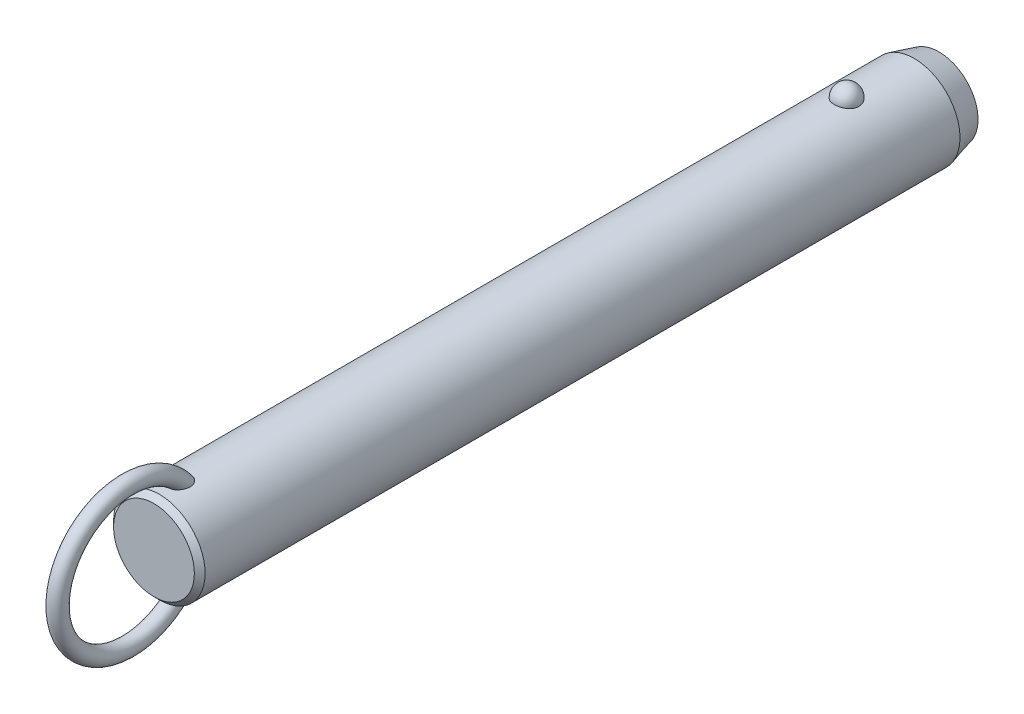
ISO-10303-21;
HEADER;
FILE_DESCRIPTION(('STEP AP214'),'2;1');
FILE_NAME('part.step','',(''),(''),'','','');
FILE_SCHEMA(('AUTOMOTIVE_DESIGN { 1 0 10303 214 1 1 1 1 }'));
ENDSEC;
DATA;
#1=APPLICATION_CONTEXT('core data for automotive mechanical design processes');
#2=APPLICATION_PROTOCOL_DEFINITION('international standard','automotive_design',2000,#1);
#3=PRODUCT_CONTEXT('',#1,'mechanical');
#4=PRODUCT('Part','Part','',(#3));
#5=PRODUCT_RELATED_PRODUCT_CATEGORY('part','',(#4));
#6=PRODUCT_DEFINITION_FORMATION('','',#4);
#7=PRODUCT_DEFINITION_CONTEXT('part definition',#1,'design');
#8=PRODUCT_DEFINITION('design','',#6,#7);
#9=PRODUCT_DEFINITION_SHAPE('','',#8);
#10=(LENGTH_UNIT() NAMED_UNIT(*) SI_UNIT(.MILLI.,.METRE.));
#11=(NAMED_UNIT(*) PLANE_ANGLE_UNIT() SI_UNIT($,.RADIAN.));
#12=(NAMED_UNIT(*) SI_UNIT($,.STERADIAN.) SOLID_ANGLE_UNIT());
#13=UNCERTAINTY_MEASURE_WITH_UNIT(LENGTH_MEASURE(1.E-05),#10,'distance_accuracy_value','');
#14=(GEOMETRIC_REPRESENTATION_CONTEXT(3) GLOBAL_UNCERTAINTY_ASSIGNED_CONTEXT((#13)) GLOBAL_UNIT_ASSIGNED_CONTEXT((#10,
#11,#12)) REPRESENTATION_CONTEXT('',''));
#15=CARTESIAN_POINT('',(0.,0.,0.));
#16=DIRECTION('',(0.,0.,1.));
#17=DIRECTION('',(1.,0.,0.));
#18=AXIS2_PLACEMENT_3D('',#15,#16,#17);
#19=CARTESIAN_POINT('',(0.,0.,152.4));
#20=DIRECTION('',(0.,0.,-1.));
#21=DIRECTION('',(-1.,0.,0.));
#22=AXIS2_PLACEMENT_3D('',#19,#20,#21);
#23=CYLINDRICAL_SURFACE('',#22,11.1);
#24=CARTESIAN_POINT('',(2.9724815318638,10.6945945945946,-3.00000000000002));
#25=CARTESIAN_POINT('',(2.97247830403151,10.6945972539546,-2.8322505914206));
#26=CARTESIAN_POINT('',(2.95876598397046,10.6984356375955,-2.66445972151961));
#27=CARTESIAN_POINT('',(2.90424529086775,10.7133624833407,-2.3336238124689));
#28=CARTESIAN_POINT('',(2.8634252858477,10.7244540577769,-2.17058084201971));
#29=CARTESIAN_POINT('',(2.75573657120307,10.7526272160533,-1.85396767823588));
#30=CARTESIAN_POINT('',(2.68887937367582,10.7697061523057,-1.70039333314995));
#31=CARTESIAN_POINT('',(2.53079696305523,10.8079438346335,-1.4069159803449));
#32=CARTESIAN_POINT('',(2.43957264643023,10.8291024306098,-1.26701246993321));
#33=CARTESIAN_POINT('',(2.23458150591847,10.8732541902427,-1.00409565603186));
#34=CARTESIAN_POINT('',(2.12071295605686,10.8962553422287,-0.88116297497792));
#35=CARTESIAN_POINT('',(1.87365402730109,10.9414421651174,-0.656352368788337));
#36=CARTESIAN_POINT('',(1.74046358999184,10.9636278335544,-0.554474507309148));
#37=CARTESIAN_POINT('',(1.45872188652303,11.0046495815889,-0.374872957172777));
#38=CARTESIAN_POINT('',(1.31021276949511,11.0234944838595,-0.297085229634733));
#39=CARTESIAN_POINT('',(1.00170030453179,11.0557957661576,-0.167529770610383));
#40=CARTESIAN_POINT('',(0.841698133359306,11.0692526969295,-0.1157593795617));
#41=CARTESIAN_POINT('',(0.517607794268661,11.0890932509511,-0.0403925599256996));
#42=CARTESIAN_POINT('',(0.353633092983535,11.0955916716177,-0.0163383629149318));
#43=CARTESIAN_POINT('',(0.023842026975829,11.1011989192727,0.00445177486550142));
#44=CARTESIAN_POINT('',(-0.141974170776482,11.1003084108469,0.00119017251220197));
#45=CARTESIAN_POINT('',(-0.468405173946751,11.0912990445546,-0.0323233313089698));
#46=CARTESIAN_POINT('',(-0.629059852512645,11.0832767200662,-0.0622147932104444));
#47=CARTESIAN_POINT('',(-0.942937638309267,11.0609962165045,-0.147645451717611));
#48=CARTESIAN_POINT('',(-1.09616062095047,11.0467379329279,-0.203185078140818));
#49=CARTESIAN_POINT('',(-1.39181061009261,11.0134071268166,-0.338752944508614));
#50=CARTESIAN_POINT('',(-1.53417383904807,10.9943086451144,-0.418913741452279));
#51=CARTESIAN_POINT('',(-1.80342160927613,10.9533667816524,-0.601448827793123));
#52=CARTESIAN_POINT('',(-1.9303046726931,10.9315231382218,-0.703825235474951));
#53=CARTESIAN_POINT('',(-2.16747598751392,10.887005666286,-0.930091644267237));
#54=CARTESIAN_POINT('',(-2.27742774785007,10.8643239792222,-1.05433291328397));
#55=CARTESIAN_POINT('',(-2.47517316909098,10.8209886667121,-1.31966633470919));
#56=CARTESIAN_POINT('',(-2.56296538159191,10.8003351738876,-1.46075958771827));
#57=CARTESIAN_POINT('',(-2.71500300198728,10.7631304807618,-1.75753646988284));
#58=CARTESIAN_POINT('',(-2.77898901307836,10.7466250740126,-1.91335887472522));
#59=CARTESIAN_POINT('',(-2.88046189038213,10.7198747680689,-2.23391529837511));
#60=CARTESIAN_POINT('',(-2.91794947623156,10.709629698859,-2.3986490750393));
#61=CARTESIAN_POINT('',(-2.96537819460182,10.6965949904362,-2.73165170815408));
#62=CARTESIAN_POINT('',(-2.97542891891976,10.693775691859,-2.89990378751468));
#63=CARTESIAN_POINT('',(-2.96804271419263,10.6958279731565,-3.23575286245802));
#64=CARTESIAN_POINT('',(-2.95060646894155,10.7006993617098,-3.4033498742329));
#65=CARTESIAN_POINT('',(-2.88883358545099,10.71753912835,-3.73233906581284));
#66=CARTESIAN_POINT('',(-2.84462026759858,10.7294749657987,-3.89375610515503));
#67=CARTESIAN_POINT('',(-2.73050447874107,10.7590797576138,-4.20667949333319));
#68=CARTESIAN_POINT('',(-2.66060103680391,10.7767489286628,-4.35818546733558));
#69=CARTESIAN_POINT('',(-2.49642559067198,10.8159599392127,-4.64785421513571));
#70=CARTESIAN_POINT('',(-2.40203047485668,10.8375211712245,-4.78594458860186));
#71=CARTESIAN_POINT('',(-2.19143488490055,10.8820570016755,-5.04410382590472));
#72=CARTESIAN_POINT('',(-2.07523364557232,10.9050316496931,-5.16417205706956));
#73=CARTESIAN_POINT('',(-1.82361254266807,10.9499219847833,-5.38334833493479));
#74=CARTESIAN_POINT('',(-1.68812945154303,10.9718338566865,-5.48238464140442));
#75=CARTESIAN_POINT('',(-1.40191298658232,11.0120611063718,-5.6561887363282));
#76=CARTESIAN_POINT('',(-1.25118062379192,11.0303767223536,-5.73095813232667));
#77=CARTESIAN_POINT('',(-0.94057074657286,11.0611653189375,-5.85334725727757));
#78=CARTESIAN_POINT('',(-0.780821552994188,11.0737044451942,-5.90127578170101));
#79=CARTESIAN_POINT('',(-0.455204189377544,11.0918598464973,-5.9699297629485));
#80=CARTESIAN_POINT('',(-0.289336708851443,11.0974768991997,-5.99065827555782));
#81=CARTESIAN_POINT('',(0.040684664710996,11.1011307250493,-6.00418773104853));
#82=CARTESIAN_POINT('',(0.204817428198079,11.099299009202,-5.9974731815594));
#83=CARTESIAN_POINT('',(0.529553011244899,11.088551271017,-5.95740317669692));
#84=CARTESIAN_POINT('',(0.690155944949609,11.0796354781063,-5.92404858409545));
#85=CARTESIAN_POINT('',(1.0027760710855,11.0557204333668,-5.83180084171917));
#86=CARTESIAN_POINT('',(1.15482001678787,11.0407414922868,-5.7729929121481));
#87=CARTESIAN_POINT('',(1.44678373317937,11.0062913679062,-5.63147366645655));
#88=CARTESIAN_POINT('',(1.58670279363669,10.9868199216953,-5.54876095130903));
#89=CARTESIAN_POINT('',(1.8527023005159,10.9451315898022,-5.36027644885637));
#90=CARTESIAN_POINT('',(1.97855158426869,10.9228788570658,-5.25418644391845));
#91=CARTESIAN_POINT('',(2.21080872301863,10.8782509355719,-5.02251354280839));
#92=CARTESIAN_POINT('',(2.31721312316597,10.8558757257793,-4.89692718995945));
#93=CARTESIAN_POINT('',(2.5094551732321,10.8130715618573,-4.62745408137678));
#94=CARTESIAN_POINT('',(2.59493284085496,10.7926798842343,-4.48330448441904));
#95=CARTESIAN_POINT('',(2.740862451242,10.7565495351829,-4.18236358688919));
#96=CARTESIAN_POINT('',(2.80132490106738,10.7408089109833,-4.02557762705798));
#97=CARTESIAN_POINT('',(2.88959070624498,10.7173718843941,-3.72475308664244));
#98=CARTESIAN_POINT('',(2.92062102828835,10.7088950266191,-3.58171216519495));
#99=CARTESIAN_POINT('',(2.96206765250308,10.6975052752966,-3.29245795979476));
#100=CARTESIAN_POINT('',(2.97248434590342,10.6945922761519,-3.14624473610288));
#101=CARTESIAN_POINT('',(2.9724815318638,10.6945945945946,-3.00000000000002));
#102=B_SPLINE_CURVE_WITH_KNOTS('',3,(#24,#25,#26,#27,#28,#29,#30,#31,#32,#33,#34,#35,#36,#37,
#38,#39,#40,#41,#42,#43,#44,#45,#46,#47,#48,#49,#50,#51,#52,#53,#54,#55,#56,#57,#58,#59,#60,#61,
#62,#63,#64,#65,#66,#67,#68,#69,#70,#71,#72,#73,#74,#75,#76,#77,#78,#79,#80,#81,#82,#83,#84,#85,
#86,#87,#88,#89,#90,#91,#92,#93,#94,#95,#96,#97,#98,#99,#100,#101),.UNSPECIFIED.,.T.,.F.,(4,2,2,
2,2,2,2,2,2,2,2,2,2,2,2,2,2,2,2,2,2,2,2,2,2,2,2,2,2,2,2,2,2,2,2,2,2,2,4),(0.,0.502722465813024,
1.00566079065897,1.50837699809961,2.01107471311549,2.51608392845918,3.02109467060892,
3.52475118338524,4.02835620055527,4.523518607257,5.0186364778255,5.50715297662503,
5.9956776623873,6.48688002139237,6.97812923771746,7.47814366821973,7.9781907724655,
8.48353712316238,8.9888697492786,9.49218093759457,9.99547960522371,10.4964777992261,
10.997494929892,11.5010810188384,12.0046847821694,12.5099796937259,13.0152411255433,
13.5145635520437,14.0138298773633,14.5043200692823,14.9947943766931,15.4836390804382,
15.9725123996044,16.4685040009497,16.9645836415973,17.4686765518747,17.972557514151,
18.410841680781,18.849117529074),.UNSPECIFIED.);
#103=CARTESIAN_POINT('',(2.9724815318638,10.6945945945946,-3.00000000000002));
#104=VERTEX_POINT('',#103);
#105=EDGE_CURVE('E41',#104,#104,#102,.T.);
#106=ORIENTED_EDGE('',*,*,#105,.T.);
#107=EDGE_LOOP('',(#106));
#108=FACE_BOUND('',#107,.T.);
#109=CARTESIAN_POINT('',(0.,0.,163.8));
#110=DIRECTION('',(0.,0.,1.));
#111=DIRECTION('',(1.,0.,0.));
#112=AXIS2_PLACEMENT_3D('',#109,#110,#111);
#113=CIRCLE('',#112,11.1);
#114=CARTESIAN_POINT('',(11.1,0.,163.8));
#115=VERTEX_POINT('',#114);
#116=EDGE_CURVE('E10',#115,#115,#113,.F.);
#117=ORIENTED_EDGE('',*,*,#116,.T.);
#118=EDGE_LOOP('',(#117));
#119=FACE_BOUND('',#118,.T.);
#120=CARTESIAN_POINT('',(-0.564520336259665,-11.0856356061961,156.057815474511));
#121=CARTESIAN_POINT('',(-0.667202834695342,-11.0804062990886,156.091283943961));
#122=CARTESIAN_POINT('',(-0.766875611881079,-11.0738877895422,156.133835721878));
#123=CARTESIAN_POINT('',(-0.957284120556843,-11.0590576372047,156.235419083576));
#124=CARTESIAN_POINT('',(-1.04801616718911,-11.0507452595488,156.29445742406));
#125=CARTESIAN_POINT('',(-1.21800952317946,-11.0333016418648,156.426529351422));
#126=CARTESIAN_POINT('',(-1.29730805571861,-11.0241732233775,156.499515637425));
#127=CARTESIAN_POINT('',(-1.44337665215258,-11.0060026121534,156.657037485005));
#128=CARTESIAN_POINT('',(-1.51014622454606,-10.9969604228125,156.741573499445));
#129=CARTESIAN_POINT('',(-1.63454620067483,-10.9791841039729,156.925521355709));
#130=CARTESIAN_POINT('',(-1.69127003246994,-10.9705107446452,157.025549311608));
#131=CARTESIAN_POINT('',(-1.7898078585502,-10.9548648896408,157.232790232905));
#132=CARTESIAN_POINT('',(-1.83161214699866,-10.9478935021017,157.340007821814));
#133=CARTESIAN_POINT('',(-1.91557028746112,-10.9335803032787,157.605408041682));
#134=CARTESIAN_POINT('',(-1.95040620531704,-10.9273269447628,157.765980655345));
#135=CARTESIAN_POINT('',(-1.99388326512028,-10.9194709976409,158.090697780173));
#136=CARTESIAN_POINT('',(-2.00248051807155,-10.9178762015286,158.254847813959));
#137=CARTESIAN_POINT('',(-1.99551615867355,-10.9191578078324,158.624650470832));
#138=CARTESIAN_POINT('',(-1.9732206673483,-10.9232807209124,158.830191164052));
#139=CARTESIAN_POINT('',(-1.9152976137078,-10.9335244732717,159.133595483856));
#140=CARTESIAN_POINT('',(-1.89184575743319,-10.9376266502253,159.234088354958));
#141=CARTESIAN_POINT('',(-1.83700674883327,-10.9469720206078,159.432855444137));
#142=CARTESIAN_POINT('',(-1.80562070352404,-10.9522150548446,159.531129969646));
#143=CARTESIAN_POINT('',(-1.73463055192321,-10.9636837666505,159.725914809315));
#144=CARTESIAN_POINT('',(-1.6949341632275,-10.9699202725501,159.822390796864));
#145=CARTESIAN_POINT('',(-1.60745141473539,-10.9830806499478,160.011626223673));
#146=CARTESIAN_POINT('',(-1.55966150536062,-10.9900048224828,160.104384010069));
#147=CARTESIAN_POINT('',(-1.45591812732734,-11.0042280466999,160.284690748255));
#148=CARTESIAN_POINT('',(-1.40000013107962,-11.0115253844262,160.372260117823));
#149=CARTESIAN_POINT('',(-1.27937470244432,-11.0261911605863,160.541029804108));
#150=CARTESIAN_POINT('',(-1.21467835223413,-11.0335594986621,160.62223795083));
#151=CARTESIAN_POINT('',(-1.08218150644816,-11.0473027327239,160.769001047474));
#152=CARTESIAN_POINT('',(-1.01522633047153,-11.0537063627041,160.835309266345));
#153=CARTESIAN_POINT('',(-0.872952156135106,-11.065850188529,160.958378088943));
#154=CARTESIAN_POINT('',(-0.797642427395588,-11.0715911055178,161.015149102));
#155=CARTESIAN_POINT('',(-0.65139686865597,-11.081071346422,161.107515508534));
#156=CARTESIAN_POINT('',(-0.581712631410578,-11.0849841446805,161.145049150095));
#157=CARTESIAN_POINT('',(-0.437066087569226,-11.0916271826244,161.208259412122));
#158=CARTESIAN_POINT('',(-0.362109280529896,-11.0943586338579,161.233948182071));
#159=CARTESIAN_POINT('',(-0.207828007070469,-11.0983242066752,161.271117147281));
#160=CARTESIAN_POINT('',(-0.128467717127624,-11.0995432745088,161.282454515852));
#161=CARTESIAN_POINT('',(0.0309101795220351,-11.1002423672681,161.288965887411));
#162=CARTESIAN_POINT('',(0.110927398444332,-11.0997233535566,161.284148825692));
#163=CARTESIAN_POINT('',(0.256406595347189,-11.097240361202,161.260959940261));
#164=CARTESIAN_POINT('',(0.322235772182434,-11.0955074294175,161.244754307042));
#165=CARTESIAN_POINT('',(0.450635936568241,-11.0910350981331,161.202600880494));
#166=CARTESIAN_POINT('',(0.513205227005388,-11.0882951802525,161.176648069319));
#167=CARTESIAN_POINT('',(0.662626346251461,-11.0805620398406,161.102607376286));
#168=CARTESIAN_POINT('',(0.74712753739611,-11.0751144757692,161.049845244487));
#169=CARTESIAN_POINT('',(0.906756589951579,-11.0631932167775,160.931720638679));
#170=CARTESIAN_POINT('',(0.98185949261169,-11.0567168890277,160.866325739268));
#171=CARTESIAN_POINT('',(1.10712207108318,-11.0447856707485,160.74226337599));
#172=CARTESIAN_POINT('',(1.15909566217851,-11.0394280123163,160.685383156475));
#173=CARTESIAN_POINT('',(1.25791923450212,-11.0286040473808,160.567327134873));
#174=CARTESIAN_POINT('',(1.30476642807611,-11.0231376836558,160.506149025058));
#175=CARTESIAN_POINT('',(1.43818612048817,-11.0068027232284,160.317305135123));
#176=CARTESIAN_POINT('',(1.51751767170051,-10.9960104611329,160.184453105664));
#177=CARTESIAN_POINT('',(1.63597546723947,-10.9788847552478,159.953137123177));
#178=CARTESIAN_POINT('',(1.6798887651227,-10.9722190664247,159.857053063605));
#179=CARTESIAN_POINT('',(1.75953241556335,-10.9597298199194,159.661431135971));
#180=CARTESIAN_POINT('',(1.79525967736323,-10.9539065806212,159.561891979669));
#181=CARTESIAN_POINT('',(1.85844731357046,-10.9433632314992,159.36021118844));
#182=CARTESIAN_POINT('',(1.88591073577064,-10.9386427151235,159.25807052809));
#183=CARTESIAN_POINT('',(1.9323432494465,-10.9305350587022,159.051819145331));
#184=CARTESIAN_POINT('',(1.95131065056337,-10.9271481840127,158.947708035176));
#185=CARTESIAN_POINT('',(1.99040203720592,-10.9201183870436,158.665458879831));
#186=CARTESIAN_POINT('',(2.00221217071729,-10.9179256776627,158.486037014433));
#187=CARTESIAN_POINT('',(1.99711676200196,-10.9188636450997,158.127713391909));
#188=CARTESIAN_POINT('',(1.98026150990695,-10.9219849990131,157.948811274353));
#189=CARTESIAN_POINT('',(1.92151657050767,-10.9324473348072,157.63645144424));
#190=CARTESIAN_POINT('',(1.88605081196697,-10.9386915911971,157.501759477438));
#191=CARTESIAN_POINT('',(1.79393020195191,-10.9541780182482,157.239966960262));
#192=CARTESIAN_POINT('',(1.73729868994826,-10.9634168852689,157.112858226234));
#193=CARTESIAN_POINT('',(1.612370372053,-10.9824218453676,156.889418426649));
#194=CARTESIAN_POINT('',(1.54715374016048,-10.9918945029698,156.791345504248));
#195=CARTESIAN_POINT('',(1.40127026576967,-11.0114415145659,156.607434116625));
#196=CARTESIAN_POINT('',(1.32060742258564,-11.0215157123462,156.521592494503));
#197=CARTESIAN_POINT('',(1.14474787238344,-11.041168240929,156.365163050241));
#198=CARTESIAN_POINT('',(1.04947805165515,-11.0507437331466,156.294656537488));
#199=CARTESIAN_POINT('',(0.847278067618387,-11.0680789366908,156.172640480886));
#200=CARTESIAN_POINT('',(0.740351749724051,-11.0758392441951,156.121124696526));
#201=CARTESIAN_POINT('',(0.529289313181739,-11.0878275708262,156.043485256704));
#202=CARTESIAN_POINT('',(0.425895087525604,-11.0923259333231,156.015377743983));
#203=CARTESIAN_POINT('',(0.215723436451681,-11.0984001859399,155.977703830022));
#204=CARTESIAN_POINT('',(0.108947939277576,-11.0999777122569,155.968127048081));
#205=CARTESIAN_POINT('',(-0.0938962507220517,-11.1000196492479,155.967877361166));
#206=CARTESIAN_POINT('',(-0.189967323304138,-11.0987797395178,155.975408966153));
#207=CARTESIAN_POINT('',(-0.379657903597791,-11.0939111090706,156.005507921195));
#208=CARTESIAN_POINT('',(-0.473277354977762,-11.0902823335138,156.028075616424));
#209=CARTESIAN_POINT('',(-0.564520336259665,-11.0856356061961,156.057815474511));
#210=B_SPLINE_CURVE_WITH_KNOTS('',3,(#120,#121,#122,#123,#124,#125,#126,#127,#128,#129,#130,
#131,#132,#133,#134,#135,#136,#137,#138,#139,#140,#141,#142,#143,#144,#145,#146,#147,#148,#149,
#150,#151,#152,#153,#154,#155,#156,#157,#158,#159,#160,#161,#162,#163,#164,#165,#166,#167,#168,
#169,#170,#171,#172,#173,#174,#175,#176,#177,#178,#179,#180,#181,#182,#183,#184,#185,#186,#187,
#188,#189,#190,#191,#192,#193,#194,#195,#196,#197,#198,#199,#200,#201,#202,#203,#204,#205,#206,
#207,#208,#209),.UNSPECIFIED.,.T.,.F.,(4,2,2,2,2,2,2,2,2,2,2,2,2,2,2,2,2,2,2,2,2,2,2,2,2,2,2,2,
2,2,2,2,2,2,2,2,2,2,2,2,2,2,2,2,4),(0.,0.323999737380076,0.648132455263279,0.971184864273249,
1.29424994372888,1.63886237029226,1.98369857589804,2.47426059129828,2.96564271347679,
3.58257396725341,3.89215258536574,4.20168803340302,4.51486273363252,4.82817514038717,
5.14015911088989,5.45175282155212,5.73442856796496,6.01679375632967,6.25364580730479,
6.49025437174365,6.7291996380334,6.96801276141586,7.17061258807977,7.37331685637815,
7.67094989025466,7.96935728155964,8.20075067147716,8.43226927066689,8.89581623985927,
9.21306533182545,9.53043400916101,9.84768549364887,10.1650000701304,10.70229304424,
11.2386443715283,11.6553390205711,12.0715755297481,12.4245637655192,12.7774607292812,
13.1321855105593,13.4867936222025,13.8068771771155,14.1267813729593,14.4146787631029,
14.7025827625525),.UNSPECIFIED.);
#211=CARTESIAN_POINT('',(-0.564520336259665,-11.0856356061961,156.057815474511));
#212=VERTEX_POINT('',#211);
#213=EDGE_CURVE('E59',#212,#212,#210,.T.);
#214=ORIENTED_EDGE('',*,*,#213,.T.);
#215=EDGE_LOOP('',(#214));
#216=FACE_BOUND('',#215,.T.);
#217=CARTESIAN_POINT('',(-0.564520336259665,11.0856356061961,156.057815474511));
#218=CARTESIAN_POINT('',(-0.46854206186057,11.0905203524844,156.026545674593));
#219=CARTESIAN_POINT('',(-0.369793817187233,11.0942886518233,156.003157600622));
#220=CARTESIAN_POINT('',(-0.169555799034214,11.0991586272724,155.973085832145));
#221=CARTESIAN_POINT('',(-0.0680604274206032,11.1002543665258,155.96643932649));
#222=CARTESIAN_POINT('',(0.13454973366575,11.099646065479,155.970157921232));
#223=CARTESIAN_POINT('',(0.235664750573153,11.0979441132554,155.98051033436));
#224=CARTESIAN_POINT('',(0.434632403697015,11.0919342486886,156.017831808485));
#225=CARTESIAN_POINT('',(0.532486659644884,11.0876276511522,156.044792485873));
#226=CARTESIAN_POINT('',(0.722445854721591,11.0768742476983,156.1144096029));
#227=CARTESIAN_POINT('',(0.814543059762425,11.0704246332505,156.157086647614));
#228=CARTESIAN_POINT('',(0.990565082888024,11.0560659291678,156.256648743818));
#229=CARTESIAN_POINT('',(1.07448844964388,11.048156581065,156.313536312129));
#230=CARTESIAN_POINT('',(1.23562672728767,11.0313221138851,156.442210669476));
#231=CARTESIAN_POINT('',(1.3124268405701,11.0223686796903,156.514511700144));
#232=CARTESIAN_POINT('',(1.45398030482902,11.0045918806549,156.670042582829));
#233=CARTESIAN_POINT('',(1.51873073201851,10.9957685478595,156.753275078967));
#234=CARTESIAN_POINT('',(1.64107232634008,10.9782087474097,156.936384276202));
#235=CARTESIAN_POINT('',(1.6974317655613,10.9695572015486,157.037089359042));
#236=CARTESIAN_POINT('',(1.79515063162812,10.9539887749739,157.245626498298));
#237=CARTESIAN_POINT('',(1.83649966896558,10.9470730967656,157.35346343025));
#238=CARTESIAN_POINT('',(1.91931148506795,10.9329211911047,157.620399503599));
#239=CARTESIAN_POINT('',(1.95340104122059,10.9267904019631,157.781861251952));
#240=CARTESIAN_POINT('',(1.99526195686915,10.9192174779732,158.10821631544));
#241=CARTESIAN_POINT('',(2.00298989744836,10.9177830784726,158.27311484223));
#242=CARTESIAN_POINT('',(1.99396251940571,10.9194420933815,158.644100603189));
#243=CARTESIAN_POINT('',(1.97050829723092,10.923774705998,158.85003871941));
#244=CARTESIAN_POINT('',(1.91079643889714,10.9343131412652,159.153901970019));
#245=CARTESIAN_POINT('',(1.88673702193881,10.9385106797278,159.254529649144));
#246=CARTESIAN_POINT('',(1.83065508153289,10.9480376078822,159.453510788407));
#247=CARTESIAN_POINT('',(1.79863369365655,10.9533668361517,159.551864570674));
#248=CARTESIAN_POINT('',(1.72633365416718,10.9649954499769,159.746720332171));
#249=CARTESIAN_POINT('',(1.68596409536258,10.9713053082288,159.84318790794));
#250=CARTESIAN_POINT('',(1.59707998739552,10.9845964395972,160.032323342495));
#251=CARTESIAN_POINT('',(1.54856169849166,10.9915780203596,160.124989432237));
#252=CARTESIAN_POINT('',(1.44330168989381,11.0058935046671,160.304975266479));
#253=CARTESIAN_POINT('',(1.3865974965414,11.0132257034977,160.392316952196));
#254=CARTESIAN_POINT('',(1.26431158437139,11.0279330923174,160.560456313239));
#255=CARTESIAN_POINT('',(1.198741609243,11.0353082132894,160.641262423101));
#256=CARTESIAN_POINT('',(1.06542088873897,11.048931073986,160.785985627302));
#257=CARTESIAN_POINT('',(0.998640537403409,11.0552153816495,160.850784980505));
#258=CARTESIAN_POINT('',(0.856896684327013,11.0671032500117,160.970846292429));
#259=CARTESIAN_POINT('',(0.781942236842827,11.0727075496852,161.026118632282));
#260=CARTESIAN_POINT('',(0.636276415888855,11.081949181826,161.115972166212));
#261=CARTESIAN_POINT('',(0.566755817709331,11.0857572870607,161.152441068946));
#262=CARTESIAN_POINT('',(0.422602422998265,11.0921860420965,161.213533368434));
#263=CARTESIAN_POINT('',(0.347974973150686,11.0948079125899,161.238168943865));
#264=CARTESIAN_POINT('',(0.194593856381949,11.0985608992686,161.273323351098));
#265=CARTESIAN_POINT('',(0.115807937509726,11.0996777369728,161.283706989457));
#266=CARTESIAN_POINT('',(-0.0422499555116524,11.1002003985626,161.288574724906));
#267=CARTESIAN_POINT('',(-0.121521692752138,11.09960699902,161.283066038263));
#268=CARTESIAN_POINT('',(-0.266046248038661,11.0970123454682,161.258827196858));
#269=CARTESIAN_POINT('',(-0.331661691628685,11.0952283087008,161.242135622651));
#270=CARTESIAN_POINT('',(-0.459588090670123,11.0906663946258,161.199111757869));
#271=CARTESIAN_POINT('',(-0.521897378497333,11.0878880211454,161.172774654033));
#272=CARTESIAN_POINT('',(-0.671446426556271,11.0800342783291,161.097513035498));
#273=CARTESIAN_POINT('',(-0.756250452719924,11.0744969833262,161.043818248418));
#274=CARTESIAN_POINT('',(-0.916349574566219,11.0624045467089,160.923802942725));
#275=CARTESIAN_POINT('',(-0.991618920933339,11.0558467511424,160.857449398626));
#276=CARTESIAN_POINT('',(-1.11713140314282,11.0437783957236,160.731633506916));
#277=CARTESIAN_POINT('',(-1.16920539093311,11.0383619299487,160.673952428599));
#278=CARTESIAN_POINT('',(-1.2681747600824,11.02743010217,160.554280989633));
#279=CARTESIAN_POINT('',(-1.31506731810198,11.0219146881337,160.492288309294));
#280=CARTESIAN_POINT('',(-1.40399813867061,11.0109399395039,160.364784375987));
#281=CARTESIAN_POINT('',(-1.44602864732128,11.0054807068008,160.299267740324));
#282=CARTESIAN_POINT('',(-1.52538779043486,10.9947621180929,160.165422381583));
#283=CARTESIAN_POINT('',(-1.56271516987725,10.9895028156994,160.097092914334));
#284=CARTESIAN_POINT('',(-1.64537943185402,10.9774790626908,159.933210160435));
#285=CARTESIAN_POINT('',(-1.68879497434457,10.9708503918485,159.8366735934));
#286=CARTESIAN_POINT('',(-1.76740738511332,10.9584602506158,159.640236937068));
#287=CARTESIAN_POINT('',(-1.80260120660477,10.95269910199,159.54033561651));
#288=CARTESIAN_POINT('',(-1.86468657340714,10.9423003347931,159.337966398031));
#289=CARTESIAN_POINT('',(-1.8915816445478,10.9376622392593,159.235499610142));
#290=CARTESIAN_POINT('',(-1.93682458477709,10.9297405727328,159.028642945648));
#291=CARTESIAN_POINT('',(-1.95517082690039,10.9264572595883,158.924252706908));
#292=CARTESIAN_POINT('',(-1.99232562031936,10.9197647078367,158.64262876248));
#293=CARTESIAN_POINT('',(-2.00294603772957,10.9177914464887,158.464185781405));
#294=CARTESIAN_POINT('',(-1.99566675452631,10.9191290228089,158.107996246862));
#295=CARTESIAN_POINT('',(-1.97781651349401,10.9224306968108,157.93024902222));
#296=CARTESIAN_POINT('',(-1.91747214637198,10.9331592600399,157.619792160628));
#297=CARTESIAN_POINT('',(-1.88131022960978,10.9395108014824,157.485825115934));
#298=CARTESIAN_POINT('',(-1.78790380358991,10.9551659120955,157.22559757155));
#299=CARTESIAN_POINT('',(-1.7306830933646,10.9644661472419,157.099328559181));
#300=CARTESIAN_POINT('',(-1.60475573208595,10.9835398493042,156.87741565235));
#301=CARTESIAN_POINT('',(-1.53908879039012,10.9930297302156,156.780026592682));
#302=CARTESIAN_POINT('',(-1.39238608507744,11.0125708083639,156.597525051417));
#303=CARTESIAN_POINT('',(-1.31135150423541,11.0226219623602,156.512411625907));
#304=CARTESIAN_POINT('',(-1.14382035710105,11.0411991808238,156.36529943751));
#305=CARTESIAN_POINT('',(-1.05858500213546,11.0497792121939,156.30186930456));
#306=CARTESIAN_POINT('',(-0.87872344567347,11.0655285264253,156.190250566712));
#307=CARTESIAN_POINT('',(-0.78412346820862,11.0727015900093,156.142020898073));
#308=CARTESIAN_POINT('',(-0.646163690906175,11.0812501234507,156.086023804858));
#309=CARTESIAN_POINT('',(-0.605595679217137,11.0835451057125,156.071197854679));
#310=CARTESIAN_POINT('',(-0.564520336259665,11.0856356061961,156.057815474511));
#311=B_SPLINE_CURVE_WITH_KNOTS('',3,(#217,#218,#219,#220,#221,#222,#223,#224,#225,#226,#227,
#228,#229,#230,#231,#232,#233,#234,#235,#236,#237,#238,#239,#240,#241,#242,#243,#244,#245,#246,
#247,#248,#249,#250,#251,#252,#253,#254,#255,#256,#257,#258,#259,#260,#261,#262,#263,#264,#265,
#266,#267,#268,#269,#270,#271,#272,#273,#274,#275,#276,#277,#278,#279,#280,#281,#282,#283,#284,
#285,#286,#287,#288,#289,#290,#291,#292,#293,#294,#295,#296,#297,#298,#299,#300,#301,#302,#303,
#304,#305,#306,#307,#308,#309,#310),.UNSPECIFIED.,.T.,.F.,(4,2,2,2,2,2,2,2,2,2,2,2,2,2,2,2,2,2,
2,2,2,2,2,2,2,2,2,2,2,2,2,2,2,2,2,2,2,2,2,2,2,2,2,2,2,2,4),(0.,0.303061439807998,
0.606795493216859,0.910302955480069,1.21365733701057,1.51741085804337,1.82121821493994,
2.13745205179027,2.45376252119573,2.79958678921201,3.14564996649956,3.63832391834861,
4.13180893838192,4.75031912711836,5.06071926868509,5.37107516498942,5.68500772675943,
5.99908475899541,6.31176519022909,6.62403542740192,6.90315673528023,7.18197194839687,
7.41687778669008,7.65154134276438,7.88841587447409,8.12518286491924,8.32752842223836,
8.52997509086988,8.82986421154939,9.13054668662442,9.36393502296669,9.5974499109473,
9.83133221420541,10.0652767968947,10.383032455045,10.7009056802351,11.0186436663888,
11.3364420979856,11.8705925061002,12.4038159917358,12.8189662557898,13.2336487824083,
13.5857049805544,13.9377340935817,14.2561354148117,14.5736690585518,14.7033687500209),.UNSPECIFIED.);
#312=CARTESIAN_POINT('',(-0.564520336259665,11.0856356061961,156.057815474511));
#313=VERTEX_POINT('',#312);
#314=EDGE_CURVE('E67',#313,#313,#311,.T.);
#315=ORIENTED_EDGE('',*,*,#314,.T.);
#316=EDGE_LOOP('',(#315));
#317=FACE_BOUND('',#316,.T.);
#318=CARTESIAN_POINT('',(0.,0.,-19.4000000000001));
#319=DIRECTION('',(0.,0.,-1.));
#320=DIRECTION('',(-1.,0.,0.));
#321=AXIS2_PLACEMENT_3D('',#318,#319,#320);
#322=CIRCLE('',#321,11.1);
#323=CARTESIAN_POINT('',(-11.1,0.,-19.4000000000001));
#324=VERTEX_POINT('',#323);
#325=EDGE_CURVE('E56',#324,#324,#322,.F.);
#326=ORIENTED_EDGE('',*,*,#325,.T.);
#327=EDGE_LOOP('',(#326));
#328=FACE_BOUND('',#327,.T.);
#329=ADVANCED_FACE('F37',(#108,#119,#216,#317,#328),#23,.T.);
#330=CARTESIAN_POINT('',(0.,0.,-25.4));
#331=DIRECTION('',(0.,0.,-1.));
#332=DIRECTION('',(-1.,0.,0.));
#333=AXIS2_PLACEMENT_3D('',#330,#331,#332);
#334=PLANE('',#333);
#335=CARTESIAN_POINT('',(0.,0.,-25.4));
#336=DIRECTION('',(0.,0.,-1.));
#337=DIRECTION('',(-1.,0.,0.));
#338=AXIS2_PLACEMENT_3D('',#335,#336,#337);
#339=CIRCLE('',#338,9.49230484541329);
#340=CARTESIAN_POINT('',(-9.49230484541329,0.,-25.4));
#341=VERTEX_POINT('',#340);
#342=EDGE_CURVE('E66',#341,#341,#339,.T.);
#343=ORIENTED_EDGE('',*,*,#342,.T.);
#344=EDGE_LOOP('',(#343));
#345=FACE_BOUND('',#344,.T.);
#346=ADVANCED_FACE('F85',(#345),#334,.T.);
#347=CARTESIAN_POINT('',(0.,0.,-25.4));
#348=DIRECTION('',(0.,0.,1.));
#349=DIRECTION('',(1.,0.,0.));
#350=AXIS2_PLACEMENT_3D('',#347,#348,#349);
#351=CONICAL_SURFACE('',#350,9.49230484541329,0.261799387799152);
#352=ORIENTED_EDGE('',*,*,#325,.F.);
#353=EDGE_LOOP('',(#352));
#354=FACE_BOUND('',#353,.T.);
#355=ORIENTED_EDGE('',*,*,#342,.F.);
#356=EDGE_LOOP('',(#355));
#357=FACE_BOUND('',#356,.T.);
#358=ADVANCED_FACE('F83',(#354,#357),#351,.T.);
#359=CARTESIAN_POINT('',(0.,0.,165.1));
#360=DIRECTION('',(0.,0.,1.));
#361=DIRECTION('',(1.,0.,0.));
#362=AXIS2_PLACEMENT_3D('',#359,#360,#361);
#363=PLANE('',#362);
#364=CARTESIAN_POINT('',(0.,0.,165.1));
#365=DIRECTION('',(0.,0.,1.));
#366=DIRECTION('',(1.,0.,0.));
#367=AXIS2_PLACEMENT_3D('',#364,#365,#366);
#368=CIRCLE('',#367,9.80000000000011);
#369=CARTESIAN_POINT('',(9.80000000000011,0.,165.1));
#370=VERTEX_POINT('',#369);
#371=EDGE_CURVE('E50',#370,#370,#368,.T.);
#372=ORIENTED_EDGE('',*,*,#371,.T.);
#373=EDGE_LOOP('',(#372));
#374=FACE_BOUND('',#373,.T.);
#375=ADVANCED_FACE('F77',(#374),#363,.T.);
#376=CARTESIAN_POINT('',(0.,0.,171.45));
#377=DIRECTION('',(1.,0.,0.));
#378=DIRECTION('',(0.,0.,-1.));
#379=AXIS2_PLACEMENT_3D('',#376,#377,#378);
#380=TOROIDAL_SURFACE('',#379,17.05,2.);
#381=ORIENTED_EDGE('',*,*,#314,.F.);
#382=EDGE_LOOP('',(#381));
#383=FACE_BOUND('',#382,.T.);
#384=ORIENTED_EDGE('',*,*,#213,.F.);
#385=EDGE_LOOP('',(#384));
#386=FACE_BOUND('',#385,.T.);
#387=ADVANCED_FACE('F73',(#383,#386),#380,.T.);
#388=CARTESIAN_POINT('',(0.,0.,165.1));
#389=DIRECTION('',(0.,0.,-1.));
#390=DIRECTION('',(-1.,0.,0.));
#391=AXIS2_PLACEMENT_3D('',#388,#389,#390);
#392=CONICAL_SURFACE('',#391,9.80000000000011,0.78539816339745);
#393=ORIENTED_EDGE('',*,*,#116,.F.);
#394=EDGE_LOOP('',(#393));
#395=FACE_BOUND('',#394,.T.);
#396=ORIENTED_EDGE('',*,*,#371,.F.);
#397=EDGE_LOOP('',(#396));
#398=FACE_BOUND('',#397,.T.);
#399=ADVANCED_FACE('F39',(#395,#398),#392,.T.);
#400=CARTESIAN_POINT('',(0.,11.1,-3.00000000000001));
#401=DIRECTION('',(0.,1.,0.));
#402=DIRECTION('',(0.,0.,-1.));
#403=AXIS2_PLACEMENT_3D('',#400,#401,#402);
#404=SPHERICAL_SURFACE('',#403,3.);
#405=ORIENTED_EDGE('',*,*,#105,.F.);
#406=EDGE_LOOP('',(#405));
#407=FACE_BOUND('',#406,.T.);
#408=ADVANCED_FACE('F79',(#407),#404,.T.);
#409=CLOSED_SHELL('',(#329,#346,#358,#375,#387,#399,#408));
#410=MANIFOLD_SOLID_BREP('B2',#409);
#411=ADVANCED_BREP_SHAPE_REPRESENTATION('',(#18,#410),#14);
#412=SHAPE_DEFINITION_REPRESENTATION(#9,#411);
ENDSEC;
END-ISO-10303-21;
